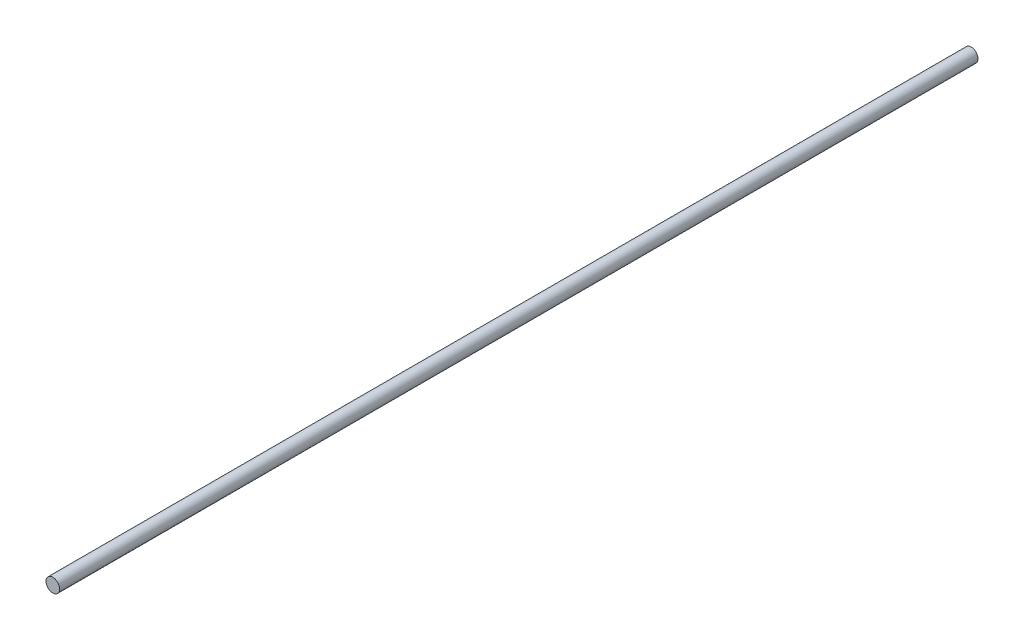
ISO-10303-21;
HEADER;
FILE_DESCRIPTION(('STEP AP214'),'2;1');
FILE_NAME('part.step','',(''),(''),'','','');
FILE_SCHEMA(('AUTOMOTIVE_DESIGN { 1 0 10303 214 1 1 1 1 }'));
ENDSEC;
DATA;
#1=APPLICATION_CONTEXT('core data for automotive mechanical design processes');
#2=APPLICATION_PROTOCOL_DEFINITION('international standard','automotive_design',2000,#1);
#3=PRODUCT_CONTEXT('',#1,'mechanical');
#4=PRODUCT('Part','Part','',(#3));
#5=PRODUCT_RELATED_PRODUCT_CATEGORY('part','',(#4));
#6=PRODUCT_DEFINITION_FORMATION('','',#4);
#7=PRODUCT_DEFINITION_CONTEXT('part definition',#1,'design');
#8=PRODUCT_DEFINITION('design','',#6,#7);
#9=PRODUCT_DEFINITION_SHAPE('','',#8);
#10=(LENGTH_UNIT() NAMED_UNIT(*) SI_UNIT(.MILLI.,.METRE.));
#11=(NAMED_UNIT(*) PLANE_ANGLE_UNIT() SI_UNIT($,.RADIAN.));
#12=(NAMED_UNIT(*) SI_UNIT($,.STERADIAN.) SOLID_ANGLE_UNIT());
#13=UNCERTAINTY_MEASURE_WITH_UNIT(LENGTH_MEASURE(1.E-05),#10,'distance_accuracy_value','');
#14=(GEOMETRIC_REPRESENTATION_CONTEXT(3) GLOBAL_UNCERTAINTY_ASSIGNED_CONTEXT((#13)) GLOBAL_UNIT_ASSIGNED_CONTEXT((#10,
#11,#12)) REPRESENTATION_CONTEXT('',''));
#15=CARTESIAN_POINT('',(0.,0.,0.));
#16=DIRECTION('',(0.,0.,1.));
#17=DIRECTION('',(1.,0.,0.));
#18=AXIS2_PLACEMENT_3D('',#15,#16,#17);
#19=CARTESIAN_POINT('',(0.,0.,-4050.));
#20=DIRECTION('',(0.,0.,1.));
#21=DIRECTION('',(1.,0.,0.));
#22=AXIS2_PLACEMENT_3D('',#19,#20,#21);
#23=CYLINDRICAL_SURFACE('',#22,30.);
#24=CARTESIAN_POINT('',(0.,0.,-4050.));
#25=DIRECTION('',(0.,0.,1.));
#26=DIRECTION('',(1.,0.,0.));
#27=AXIS2_PLACEMENT_3D('',#24,#25,#26);
#28=CIRCLE('',#27,30.);
#29=CARTESIAN_POINT('',(30.,0.,-4050.));
#30=VERTEX_POINT('',#29);
#31=EDGE_CURVE('E10',#30,#30,#28,.T.);
#32=ORIENTED_EDGE('',*,*,#31,.T.);
#33=EDGE_LOOP('',(#32));
#34=FACE_BOUND('',#33,.T.);
#35=CARTESIAN_POINT('',(0.,0.,0.));
#36=DIRECTION('',(0.,0.,1.));
#37=DIRECTION('',(1.,0.,0.));
#38=AXIS2_PLACEMENT_3D('',#35,#36,#37);
#39=CIRCLE('',#38,30.);
#40=CARTESIAN_POINT('',(30.,0.,0.));
#41=VERTEX_POINT('',#40);
#42=EDGE_CURVE('E40',#41,#41,#39,.T.);
#43=ORIENTED_EDGE('',*,*,#42,.F.);
#44=EDGE_LOOP('',(#43));
#45=FACE_BOUND('',#44,.T.);
#46=ADVANCED_FACE('F37',(#34,#45),#23,.T.);
#47=CARTESIAN_POINT('',(0.,0.,-4050.));
#48=DIRECTION('',(0.,0.,1.));
#49=DIRECTION('',(1.,0.,0.));
#50=AXIS2_PLACEMENT_3D('',#47,#48,#49);
#51=PLANE('',#50);
#52=ORIENTED_EDGE('',*,*,#31,.F.);
#53=EDGE_LOOP('',(#52));
#54=FACE_BOUND('',#53,.T.);
#55=ADVANCED_FACE('F54',(#54),#51,.F.);
#56=CARTESIAN_POINT('',(0.,0.,0.));
#57=DIRECTION('',(0.,0.,1.));
#58=DIRECTION('',(1.,0.,0.));
#59=AXIS2_PLACEMENT_3D('',#56,#57,#58);
#60=PLANE('',#59);
#61=ORIENTED_EDGE('',*,*,#42,.T.);
#62=EDGE_LOOP('',(#61));
#63=FACE_BOUND('',#62,.T.);
#64=ADVANCED_FACE('F51',(#63),#60,.T.);
#65=CLOSED_SHELL('',(#46,#55,#64));
#66=MANIFOLD_SOLID_BREP('B2',#65);
#67=ADVANCED_BREP_SHAPE_REPRESENTATION('',(#18,#66),#14);
#68=SHAPE_DEFINITION_REPRESENTATION(#9,#67);
ENDSEC;
END-ISO-10303-21;
